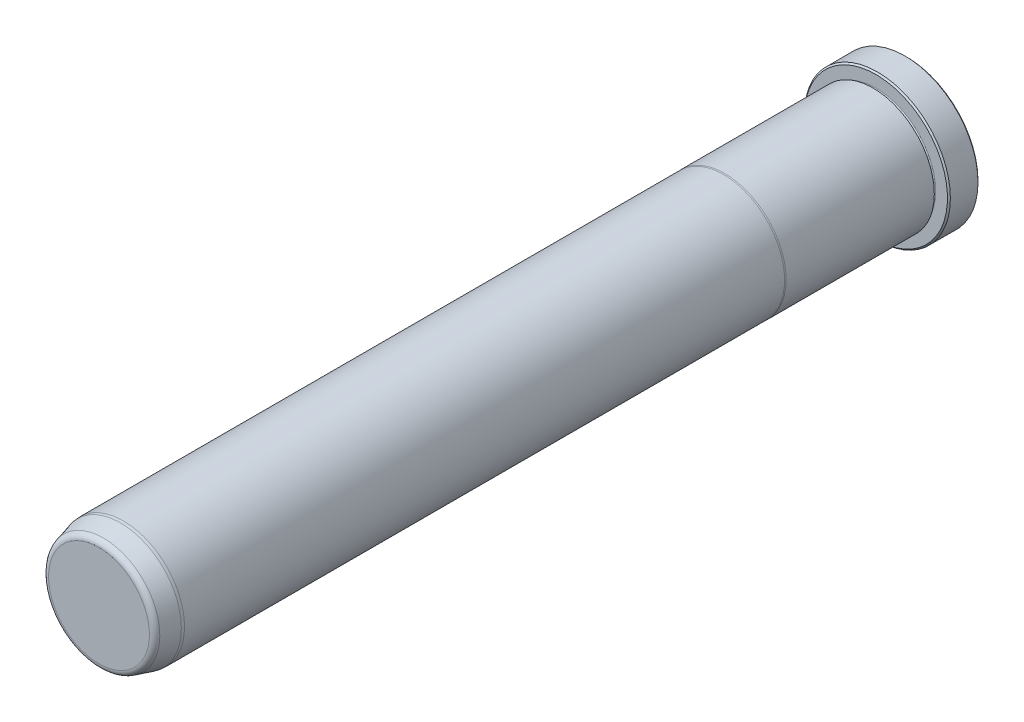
ISO-10303-21;
HEADER;
FILE_DESCRIPTION(('STEP AP214'),'2;1');
FILE_NAME('part.step','',(''),(''),'','','');
FILE_SCHEMA(('AUTOMOTIVE_DESIGN { 1 0 10303 214 1 1 1 1 }'));
ENDSEC;
DATA;
#1=APPLICATION_CONTEXT('core data for automotive mechanical design processes');
#2=APPLICATION_PROTOCOL_DEFINITION('international standard','automotive_design',2000,#1);
#3=PRODUCT_CONTEXT('',#1,'mechanical');
#4=PRODUCT('Part','Part','',(#3));
#5=PRODUCT_RELATED_PRODUCT_CATEGORY('part','',(#4));
#6=PRODUCT_DEFINITION_FORMATION('','',#4);
#7=PRODUCT_DEFINITION_CONTEXT('part definition',#1,'design');
#8=PRODUCT_DEFINITION('design','',#6,#7);
#9=PRODUCT_DEFINITION_SHAPE('','',#8);
#10=(LENGTH_UNIT() NAMED_UNIT(*) SI_UNIT(.MILLI.,.METRE.));
#11=(NAMED_UNIT(*) PLANE_ANGLE_UNIT() SI_UNIT($,.RADIAN.));
#12=(NAMED_UNIT(*) SI_UNIT($,.STERADIAN.) SOLID_ANGLE_UNIT());
#13=UNCERTAINTY_MEASURE_WITH_UNIT(LENGTH_MEASURE(1.E-05),#10,'distance_accuracy_value','');
#14=(GEOMETRIC_REPRESENTATION_CONTEXT(3) GLOBAL_UNCERTAINTY_ASSIGNED_CONTEXT((#13)) GLOBAL_UNIT_ASSIGNED_CONTEXT((#10,
#11,#12)) REPRESENTATION_CONTEXT('',''));
#15=CARTESIAN_POINT('',(0.,0.,0.));
#16=DIRECTION('',(0.,0.,1.));
#17=DIRECTION('',(1.,0.,0.));
#18=AXIS2_PLACEMENT_3D('',#15,#16,#17);
#19=CARTESIAN_POINT('',(0.,0.,0.));
#20=DIRECTION('',(0.,0.,1.));
#21=DIRECTION('',(1.,0.,0.));
#22=AXIS2_PLACEMENT_3D('',#19,#20,#21);
#23=PLANE('',#22);
#24=CARTESIAN_POINT('',(0.,0.,0.));
#25=DIRECTION('',(0.,0.,1.));
#26=DIRECTION('',(1.,0.,0.));
#27=AXIS2_PLACEMENT_3D('',#24,#25,#26);
#28=CIRCLE('',#27,18.542);
#29=CARTESIAN_POINT('',(18.542,0.,0.));
#30=VERTEX_POINT('',#29);
#31=EDGE_CURVE('E37',#30,#30,#28,.F.);
#32=ORIENTED_EDGE('',*,*,#31,.T.);
#33=EDGE_LOOP('',(#32));
#34=FACE_BOUND('',#33,.T.);
#35=ADVANCED_FACE('F30',(#34),#23,.F.);
#36=CARTESIAN_POINT('',(0.,0.,0.));
#37=DIRECTION('',(0.,0.,1.));
#38=DIRECTION('',(1.,0.,0.));
#39=AXIS2_PLACEMENT_3D('',#36,#37,#38);
#40=CYLINDRICAL_SURFACE('',#39,18.923);
#41=CARTESIAN_POINT('',(0.,0.,0.380999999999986));
#42=DIRECTION('',(0.,0.,1.));
#43=DIRECTION('',(1.,0.,0.));
#44=AXIS2_PLACEMENT_3D('',#41,#42,#43);
#45=CIRCLE('',#44,18.923);
#46=CARTESIAN_POINT('',(18.923,0.,0.380999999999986));
#47=VERTEX_POINT('',#46);
#48=EDGE_CURVE('E41',#47,#47,#45,.T.);
#49=ORIENTED_EDGE('',*,*,#48,.T.);
#50=EDGE_LOOP('',(#49));
#51=FACE_BOUND('',#50,.T.);
#52=CARTESIAN_POINT('',(0.,0.,7.54380000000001));
#53=DIRECTION('',(0.,0.,-1.));
#54=DIRECTION('',(-1.,0.,0.));
#55=AXIS2_PLACEMENT_3D('',#52,#53,#54);
#56=CIRCLE('',#55,18.923);
#57=CARTESIAN_POINT('',(-18.923,0.,7.54380000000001));
#58=VERTEX_POINT('',#57);
#59=EDGE_CURVE('E45',#58,#58,#56,.T.);
#60=ORIENTED_EDGE('',*,*,#59,.T.);
#61=EDGE_LOOP('',(#60));
#62=FACE_BOUND('',#61,.T.);
#63=ADVANCED_FACE('F118',(#51,#62),#40,.T.);
#64=CARTESIAN_POINT('',(0.,18.923,7.9248));
#65=DIRECTION('',(0.,0.,-1.));
#66=DIRECTION('',(-1.,0.,0.));
#67=AXIS2_PLACEMENT_3D('',#64,#65,#66);
#68=PLANE('',#67);
#69=CARTESIAN_POINT('',(0.,0.,7.9248));
#70=DIRECTION('',(0.,0.,-1.));
#71=DIRECTION('',(-1.,0.,0.));
#72=AXIS2_PLACEMENT_3D('',#69,#70,#71);
#73=CIRCLE('',#72,18.542);
#74=CARTESIAN_POINT('',(-18.542,0.,7.9248));
#75=VERTEX_POINT('',#74);
#76=EDGE_CURVE('E10',#75,#75,#73,.F.);
#77=ORIENTED_EDGE('',*,*,#76,.T.);
#78=EDGE_LOOP('',(#77));
#79=FACE_BOUND('',#78,.T.);
#80=CARTESIAN_POINT('',(0.,0.,7.9248));
#81=DIRECTION('',(0.,0.,1.));
#82=DIRECTION('',(1.,0.,0.));
#83=AXIS2_PLACEMENT_3D('',#80,#81,#82);
#84=CIRCLE('',#83,15.4813);
#85=CARTESIAN_POINT('',(15.4813,0.,7.9248));
#86=VERTEX_POINT('',#85);
#87=EDGE_CURVE('E56',#86,#86,#84,.T.);
#88=ORIENTED_EDGE('',*,*,#87,.F.);
#89=EDGE_LOOP('',(#88));
#90=FACE_BOUND('',#89,.T.);
#91=ADVANCED_FACE('F113',(#79,#90),#68,.F.);
#92=CARTESIAN_POINT('',(0.,0.,8.3058));
#93=DIRECTION('',(0.,0.,1.));
#94=DIRECTION('',(1.,0.,0.));
#95=AXIS2_PLACEMENT_3D('',#92,#93,#94);
#96=TOROIDAL_SURFACE('',#95,15.4813,0.381000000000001);
#97=CARTESIAN_POINT('',(0.,0.,8.6868));
#98=DIRECTION('',(0.,0.,1.));
#99=DIRECTION('',(1.,0.,0.));
#100=AXIS2_PLACEMENT_3D('',#97,#98,#99);
#101=CIRCLE('',#100,15.4813);
#102=CARTESIAN_POINT('',(15.4813,0.,8.6868));
#103=VERTEX_POINT('',#102);
#104=EDGE_CURVE('E59',#103,#103,#101,.T.);
#105=ORIENTED_EDGE('',*,*,#104,.F.);
#106=EDGE_LOOP('',(#105));
#107=FACE_BOUND('',#106,.T.);
#108=ORIENTED_EDGE('',*,*,#87,.T.);
#109=EDGE_LOOP('',(#108));
#110=FACE_BOUND('',#109,.T.);
#111=ADVANCED_FACE('F107',(#107,#110),#96,.F.);
#112=CARTESIAN_POINT('',(0.,15.4813,8.6868));
#113=DIRECTION('',(0.,0.,1.));
#114=DIRECTION('',(1.,0.,0.));
#115=AXIS2_PLACEMENT_3D('',#112,#113,#114);
#116=PLANE('',#115);
#117=CARTESIAN_POINT('',(0.,0.,8.6868));
#118=DIRECTION('',(0.,0.,1.));
#119=DIRECTION('',(1.,0.,0.));
#120=AXIS2_PLACEMENT_3D('',#117,#118,#119);
#121=CIRCLE('',#120,15.8877);
#122=CARTESIAN_POINT('',(15.8877,0.,8.6868));
#123=VERTEX_POINT('',#122);
#124=EDGE_CURVE('E62',#123,#123,#121,.T.);
#125=ORIENTED_EDGE('',*,*,#124,.F.);
#126=EDGE_LOOP('',(#125));
#127=FACE_BOUND('',#126,.T.);
#128=ORIENTED_EDGE('',*,*,#104,.T.);
#129=EDGE_LOOP('',(#128));
#130=FACE_BOUND('',#129,.T.);
#131=ADVANCED_FACE('F101',(#127,#130),#116,.F.);
#132=CARTESIAN_POINT('',(0.,0.,0.));
#133=DIRECTION('',(0.,0.,1.));
#134=DIRECTION('',(1.,0.,0.));
#135=AXIS2_PLACEMENT_3D('',#132,#133,#134);
#136=CYLINDRICAL_SURFACE('',#135,15.8877);
#137=CARTESIAN_POINT('',(0.,0.,47.1347630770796));
#138=DIRECTION('',(0.,0.,1.));
#139=DIRECTION('',(1.,0.,0.));
#140=AXIS2_PLACEMENT_3D('',#137,#138,#139);
#141=CIRCLE('',#140,15.8877);
#142=CARTESIAN_POINT('',(15.8877,0.,47.1347630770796));
#143=VERTEX_POINT('',#142);
#144=EDGE_CURVE('E65',#143,#143,#141,.T.);
#145=ORIENTED_EDGE('',*,*,#144,.F.);
#146=EDGE_LOOP('',(#145));
#147=FACE_BOUND('',#146,.T.);
#148=ORIENTED_EDGE('',*,*,#124,.T.);
#149=EDGE_LOOP('',(#148));
#150=FACE_BOUND('',#149,.T.);
#151=ADVANCED_FACE('F95',(#147,#150),#136,.T.);
#152=CARTESIAN_POINT('',(0.,0.,47.1347630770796));
#153=DIRECTION('',(0.,0.,-1.));
#154=DIRECTION('',(-1.,0.,0.));
#155=AXIS2_PLACEMENT_3D('',#152,#153,#154);
#156=CONICAL_SURFACE('',#155,15.8877,0.0698131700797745);
#157=CARTESIAN_POINT('',(0.,0.,47.498));
#158=DIRECTION('',(0.,0.,1.));
#159=DIRECTION('',(1.,0.,0.));
#160=AXIS2_PLACEMENT_3D('',#157,#158,#159);
#161=CIRCLE('',#160,15.8623);
#162=CARTESIAN_POINT('',(15.8623,0.,47.498));
#163=VERTEX_POINT('',#162);
#164=EDGE_CURVE('E68',#163,#163,#161,.T.);
#165=ORIENTED_EDGE('',*,*,#164,.F.);
#166=EDGE_LOOP('',(#165));
#167=FACE_BOUND('',#166,.T.);
#168=ORIENTED_EDGE('',*,*,#144,.T.);
#169=EDGE_LOOP('',(#168));
#170=FACE_BOUND('',#169,.T.);
#171=ADVANCED_FACE('F89',(#167,#170),#156,.T.);
#172=CARTESIAN_POINT('',(0.,0.,0.));
#173=DIRECTION('',(0.,0.,1.));
#174=DIRECTION('',(1.,0.,0.));
#175=AXIS2_PLACEMENT_3D('',#172,#173,#174);
#176=CYLINDRICAL_SURFACE('',#175,15.8623);
#177=CARTESIAN_POINT('',(0.,0.,203.2));
#178=DIRECTION('',(0.,0.,1.));
#179=DIRECTION('',(1.,0.,0.));
#180=AXIS2_PLACEMENT_3D('',#177,#178,#179);
#181=CIRCLE('',#180,15.8623);
#182=CARTESIAN_POINT('',(15.8623,0.,203.2));
#183=VERTEX_POINT('',#182);
#184=EDGE_CURVE('E71',#183,#183,#181,.T.);
#185=ORIENTED_EDGE('',*,*,#184,.F.);
#186=EDGE_LOOP('',(#185));
#187=FACE_BOUND('',#186,.T.);
#188=ORIENTED_EDGE('',*,*,#164,.T.);
#189=EDGE_LOOP('',(#188));
#190=FACE_BOUND('',#189,.T.);
#191=ADVANCED_FACE('F83',(#187,#190),#176,.T.);
#192=CARTESIAN_POINT('',(0.,0.,203.2));
#193=DIRECTION('',(0.,0.,-1.));
#194=DIRECTION('',(-1.,0.,0.));
#195=AXIS2_PLACEMENT_3D('',#192,#193,#194);
#196=CONICAL_SURFACE('',#195,15.8623,0.0872664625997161);
#197=CARTESIAN_POINT('',(0.,0.,203.962));
#198=DIRECTION('',(0.,0.,1.));
#199=DIRECTION('',(1.,0.,0.));
#200=AXIS2_PLACEMENT_3D('',#197,#198,#199);
#201=CIRCLE('',#200,15.7956336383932);
#202=CARTESIAN_POINT('',(15.7956336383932,0.,203.962));
#203=VERTEX_POINT('',#202);
#204=EDGE_CURVE('E74',#203,#203,#201,.T.);
#205=ORIENTED_EDGE('',*,*,#204,.F.);
#206=EDGE_LOOP('',(#205));
#207=FACE_BOUND('',#206,.T.);
#208=ORIENTED_EDGE('',*,*,#184,.T.);
#209=EDGE_LOOP('',(#208));
#210=FACE_BOUND('',#209,.T.);
#211=ADVANCED_FACE('F80',(#207,#210),#196,.T.);
#212=CARTESIAN_POINT('',(0.,0.,203.962));
#213=DIRECTION('',(0.,0.,-1.));
#214=DIRECTION('',(-1.,0.,0.));
#215=AXIS2_PLACEMENT_3D('',#212,#213,#214);
#216=CONICAL_SURFACE('',#215,15.7956336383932,0.26179938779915);
#217=CARTESIAN_POINT('',(0.,0.,208.3733752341));
#218=DIRECTION('',(0.,0.,1.));
#219=DIRECTION('',(1.,0.,0.));
#220=AXIS2_PLACEMENT_3D('',#217,#218,#219);
#221=CIRCLE('',#220,14.6136092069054);
#222=CARTESIAN_POINT('',(14.6136092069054,0.,208.3733752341));
#223=VERTEX_POINT('',#222);
#224=EDGE_CURVE('E50',#223,#223,#221,.F.);
#225=ORIENTED_EDGE('',*,*,#224,.T.);
#226=EDGE_LOOP('',(#225));
#227=FACE_BOUND('',#226,.T.);
#228=ORIENTED_EDGE('',*,*,#204,.T.);
#229=EDGE_LOOP('',(#228));
#230=FACE_BOUND('',#229,.T.);
#231=ADVANCED_FACE('F78',(#227,#230),#216,.T.);
#232=CARTESIAN_POINT('',(0.,14.2983335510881,209.55));
#233=DIRECTION('',(0.,0.,-1.));
#234=DIRECTION('',(-1.,0.,0.));
#235=AXIS2_PLACEMENT_3D('',#232,#233,#234);
#236=PLANE('',#235);
#237=CARTESIAN_POINT('',(0.,0.,209.55));
#238=DIRECTION('',(0.,0.,-1.));
#239=DIRECTION('',(-1.,0.,0.));
#240=AXIS2_PLACEMENT_3D('',#237,#238,#239);
#241=CIRCLE('',#240,13.0802019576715);
#242=CARTESIAN_POINT('',(-13.0802019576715,0.,209.55));
#243=VERTEX_POINT('',#242);
#244=EDGE_CURVE('E53',#243,#243,#241,.F.);
#245=ORIENTED_EDGE('',*,*,#244,.T.);
#246=EDGE_LOOP('',(#245));
#247=FACE_BOUND('',#246,.T.);
#248=ADVANCED_FACE('F133',(#247),#236,.F.);
#249=CARTESIAN_POINT('',(0.,0.,207.9625));
#250=DIRECTION('',(0.,0.,-1.));
#251=DIRECTION('',(-1.,0.,0.));
#252=AXIS2_PLACEMENT_3D('',#249,#250,#251);
#253=TOROIDAL_SURFACE('',#252,13.0802019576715,1.5875);
#254=ORIENTED_EDGE('',*,*,#224,.F.);
#255=EDGE_LOOP('',(#254));
#256=FACE_BOUND('',#255,.T.);
#257=ORIENTED_EDGE('',*,*,#244,.F.);
#258=EDGE_LOOP('',(#257));
#259=FACE_BOUND('',#258,.T.);
#260=ADVANCED_FACE('F130',(#256,#259),#253,.T.);
#261=CARTESIAN_POINT('',(0.,0.,0.380999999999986));
#262=DIRECTION('',(0.,0.,1.));
#263=DIRECTION('',(1.,0.,0.));
#264=AXIS2_PLACEMENT_3D('',#261,#262,#263);
#265=CONICAL_SURFACE('',#264,18.923,0.785398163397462);
#266=ORIENTED_EDGE('',*,*,#31,.F.);
#267=EDGE_LOOP('',(#266));
#268=FACE_BOUND('',#267,.T.);
#269=ORIENTED_EDGE('',*,*,#48,.F.);
#270=EDGE_LOOP('',(#269));
#271=FACE_BOUND('',#270,.T.);
#272=ADVANCED_FACE('F132',(#268,#271),#265,.T.);
#273=CARTESIAN_POINT('',(0.,0.,7.9248));
#274=DIRECTION('',(0.,0.,-1.));
#275=DIRECTION('',(-1.,0.,0.));
#276=AXIS2_PLACEMENT_3D('',#273,#274,#275);
#277=CONICAL_SURFACE('',#276,18.542,0.785398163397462);
#278=ORIENTED_EDGE('',*,*,#59,.F.);
#279=EDGE_LOOP('',(#278));
#280=FACE_BOUND('',#279,.T.);
#281=ORIENTED_EDGE('',*,*,#76,.F.);
#282=EDGE_LOOP('',(#281));
#283=FACE_BOUND('',#282,.T.);
#284=ADVANCED_FACE('F32',(#280,#283),#277,.T.);
#285=CLOSED_SHELL('',(#35,#63,#91,#111,#131,#151,#171,#191,#211,#231,#248,#260,#272,#284));
#286=MANIFOLD_SOLID_BREP('B2',#285);
#287=ADVANCED_BREP_SHAPE_REPRESENTATION('',(#18,#286),#14);
#288=SHAPE_DEFINITION_REPRESENTATION(#9,#287);
ENDSEC;
END-ISO-10303-21;
